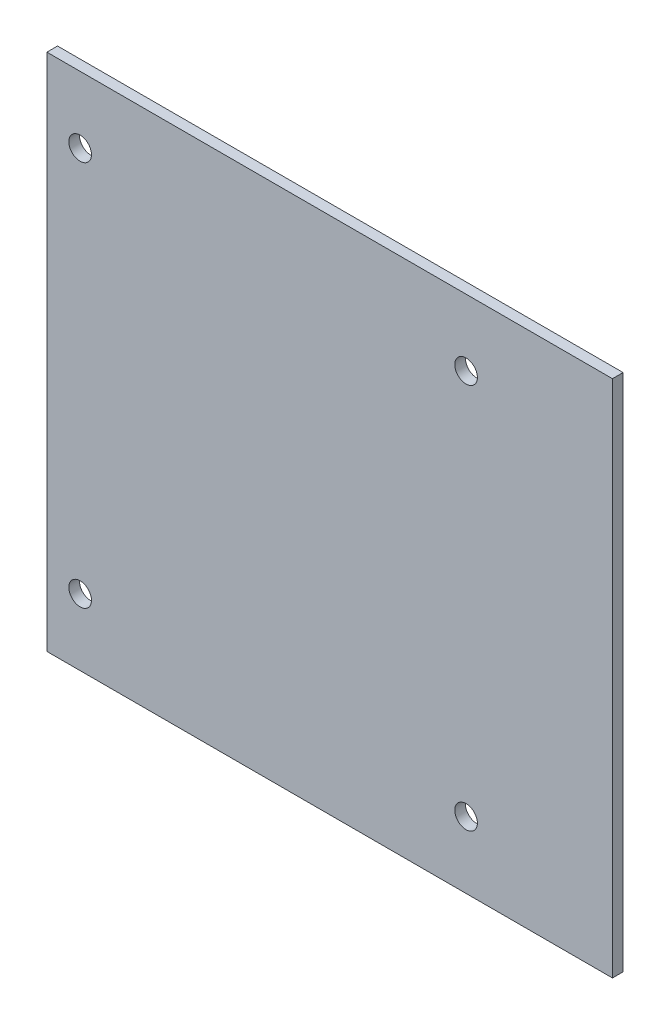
from build123d import *

# Parameters (mm, degrees)
SKETCH_1_W          = 85
SKETCH_1_H          = 78
EXTRUDE_1_DEPTH     = 1.6
SKETCH_2_R          = 1.7
CUT_EXTRUDE_1_DEPTH = 58.70450589


with BuildPart() as part:
    # Sketch 1 → Extrude 1 (new body)
    with BuildSketch(Plane.XY):
        Rectangle(SKETCH_1_W, SKETCH_1_H)
    extrude(amount=EXTRUDE_1_DEPTH)

    # Sketch 2 → Cut-Extrude 1 (cut, through all)
    with BuildSketch(Plane(origin=(0, 0, 0), x_dir=(-1, 0, 0), z_dir=(0, 0, -1))):
        with Locations((37.50000256, -29.00000116)):
            Circle(SKETCH_2_R)
        with Locations((-20.49999828, -29.00000116)):
            Circle(SKETCH_2_R)
        with Locations((37.50000002, 28.99999968)):
            Circle(SKETCH_2_R)
        with Locations((-20.49999828, 28.99999968)):
            Circle(SKETCH_2_R)
    extrude(amount=-CUT_EXTRUDE_1_DEPTH, mode=Mode.SUBTRACT)


solid = part.part
